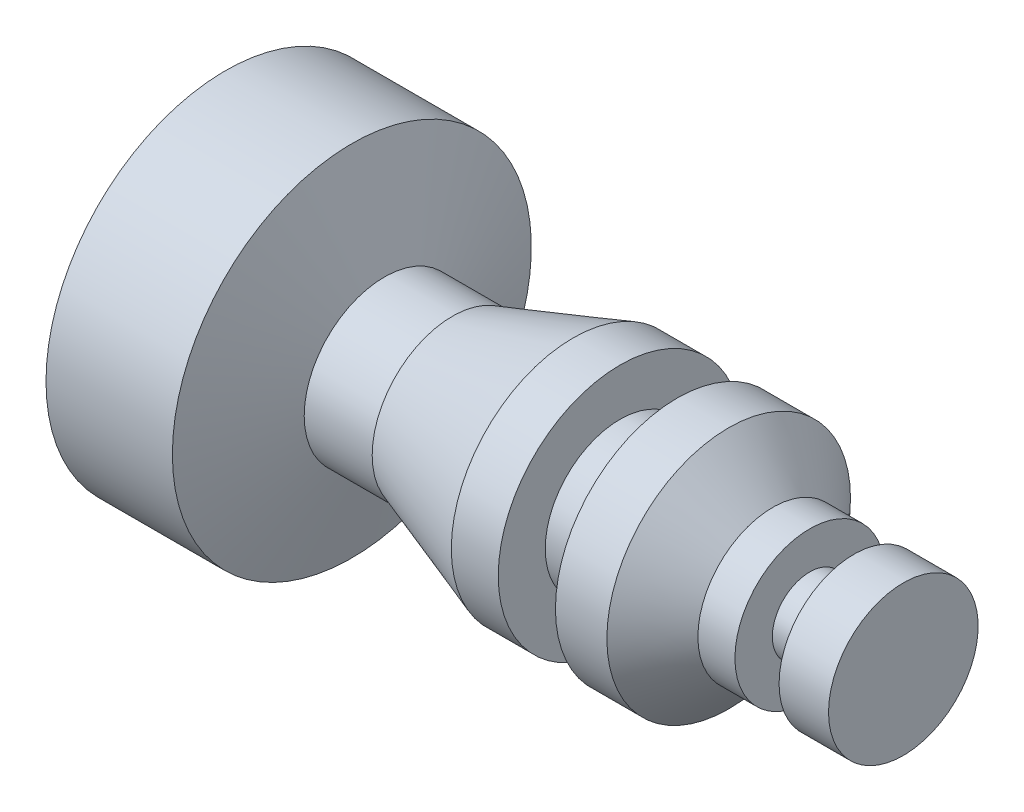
ISO-10303-21;
HEADER;
FILE_DESCRIPTION(('STEP AP214'),'2;1');
FILE_NAME('part.step','',(''),(''),'','','');
FILE_SCHEMA(('AUTOMOTIVE_DESIGN { 1 0 10303 214 1 1 1 1 }'));
ENDSEC;
DATA;
#1=APPLICATION_CONTEXT('core data for automotive mechanical design processes');
#2=APPLICATION_PROTOCOL_DEFINITION('international standard','automotive_design',2000,#1);
#3=PRODUCT_CONTEXT('',#1,'mechanical');
#4=PRODUCT('Part','Part','',(#3));
#5=PRODUCT_RELATED_PRODUCT_CATEGORY('part','',(#4));
#6=PRODUCT_DEFINITION_FORMATION('','',#4);
#7=PRODUCT_DEFINITION_CONTEXT('part definition',#1,'design');
#8=PRODUCT_DEFINITION('design','',#6,#7);
#9=PRODUCT_DEFINITION_SHAPE('','',#8);
#10=(LENGTH_UNIT() NAMED_UNIT(*) SI_UNIT(.MILLI.,.METRE.));
#11=(NAMED_UNIT(*) PLANE_ANGLE_UNIT() SI_UNIT($,.RADIAN.));
#12=(NAMED_UNIT(*) SI_UNIT($,.STERADIAN.) SOLID_ANGLE_UNIT());
#13=UNCERTAINTY_MEASURE_WITH_UNIT(LENGTH_MEASURE(1.E-05),#10,'distance_accuracy_value','');
#14=(GEOMETRIC_REPRESENTATION_CONTEXT(3) GLOBAL_UNCERTAINTY_ASSIGNED_CONTEXT((#13)) GLOBAL_UNIT_ASSIGNED_CONTEXT((#10,
#11,#12)) REPRESENTATION_CONTEXT('',''));
#15=CARTESIAN_POINT('',(0.,0.,0.));
#16=DIRECTION('',(0.,0.,1.));
#17=DIRECTION('',(1.,0.,0.));
#18=AXIS2_PLACEMENT_3D('',#15,#16,#17);
#19=CARTESIAN_POINT('',(178.686122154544,0.,0.));
#20=DIRECTION('',(1.,0.,0.));
#21=DIRECTION('',(0.,0.,-1.));
#22=AXIS2_PLACEMENT_3D('',#19,#20,#21);
#23=PLANE('',#22);
#24=CARTESIAN_POINT('',(178.686122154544,0.,0.));
#25=DIRECTION('',(-1.,0.,0.));
#26=DIRECTION('',(0.,0.,1.));
#27=AXIS2_PLACEMENT_3D('',#24,#25,#26);
#28=CIRCLE('',#27,34.5399453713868);
#29=CARTESIAN_POINT('',(178.686122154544,0.,34.5399453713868));
#30=VERTEX_POINT('',#29);
#31=EDGE_CURVE('E10',#30,#30,#28,.T.);
#32=ORIENTED_EDGE('',*,*,#31,.T.);
#33=EDGE_LOOP('',(#32));
#34=FACE_BOUND('',#33,.T.);
#35=ADVANCED_FACE('F35',(#34),#23,.F.);
#36=CARTESIAN_POINT('',(178.686122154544,0.,0.));
#37=DIRECTION('',(-1.,0.,0.));
#38=DIRECTION('',(0.,0.,1.));
#39=AXIS2_PLACEMENT_3D('',#36,#37,#38);
#40=CYLINDRICAL_SURFACE('',#39,34.5399453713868);
#41=ORIENTED_EDGE('',*,*,#31,.F.);
#42=EDGE_LOOP('',(#41));
#43=FACE_BOUND('',#42,.T.);
#44=CARTESIAN_POINT('',(203.007831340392,0.,0.));
#45=DIRECTION('',(-1.,0.,0.));
#46=DIRECTION('',(0.,0.,1.));
#47=AXIS2_PLACEMENT_3D('',#44,#45,#46);
#48=CIRCLE('',#47,34.5399453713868);
#49=CARTESIAN_POINT('',(203.007831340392,0.,34.5399453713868));
#50=VERTEX_POINT('',#49);
#51=EDGE_CURVE('E41',#50,#50,#48,.T.);
#52=ORIENTED_EDGE('',*,*,#51,.T.);
#53=EDGE_LOOP('',(#52));
#54=FACE_BOUND('',#53,.T.);
#55=ADVANCED_FACE('F103',(#43,#54),#40,.T.);
#56=CARTESIAN_POINT('',(209.278776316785,0.,0.));
#57=DIRECTION('',(-1.,0.,0.));
#58=DIRECTION('',(0.,0.,1.));
#59=AXIS2_PLACEMENT_3D('',#56,#57,#58);
#60=CONICAL_SURFACE('',#59,15.4420674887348,1.25353004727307);
#61=ORIENTED_EDGE('',*,*,#51,.F.);
#62=EDGE_LOOP('',(#61));
#63=FACE_BOUND('',#62,.T.);
#64=CARTESIAN_POINT('',(209.278776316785,0.,0.));
#65=DIRECTION('',(-1.,0.,0.));
#66=DIRECTION('',(0.,0.,1.));
#67=AXIS2_PLACEMENT_3D('',#64,#65,#66);
#68=CIRCLE('',#67,15.4420674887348);
#69=CARTESIAN_POINT('',(209.278776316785,0.,15.4420674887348));
#70=VERTEX_POINT('',#69);
#71=EDGE_CURVE('E45',#70,#70,#68,.T.);
#72=ORIENTED_EDGE('',*,*,#71,.T.);
#73=EDGE_LOOP('',(#72));
#74=FACE_BOUND('',#73,.T.);
#75=ADVANCED_FACE('F107',(#63,#74),#60,.T.);
#76=CARTESIAN_POINT('',(178.686122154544,0.,0.));
#77=DIRECTION('',(-1.,0.,0.));
#78=DIRECTION('',(0.,0.,1.));
#79=AXIS2_PLACEMENT_3D('',#76,#77,#78);
#80=CYLINDRICAL_SURFACE('',#79,15.4420674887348);
#81=ORIENTED_EDGE('',*,*,#71,.F.);
#82=EDGE_LOOP('',(#81));
#83=FACE_BOUND('',#82,.T.);
#84=CARTESIAN_POINT('',(222.363788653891,0.,0.));
#85=DIRECTION('',(-1.,0.,0.));
#86=DIRECTION('',(0.,0.,1.));
#87=AXIS2_PLACEMENT_3D('',#84,#85,#86);
#88=CIRCLE('',#87,15.4420674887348);
#89=CARTESIAN_POINT('',(222.363788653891,0.,15.4420674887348));
#90=VERTEX_POINT('',#89);
#91=EDGE_CURVE('E49',#90,#90,#88,.T.);
#92=ORIENTED_EDGE('',*,*,#91,.T.);
#93=EDGE_LOOP('',(#92));
#94=FACE_BOUND('',#93,.T.);
#95=ADVANCED_FACE('F112',(#83,#94),#80,.T.);
#96=CARTESIAN_POINT('',(245.590937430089,0.,0.));
#97=DIRECTION('',(1.,0.,0.));
#98=DIRECTION('',(0.,0.,-1.));
#99=AXIS2_PLACEMENT_3D('',#96,#97,#98);
#100=CONICAL_SURFACE('',#99,23.4425298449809,0.331717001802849);
#101=ORIENTED_EDGE('',*,*,#91,.F.);
#102=EDGE_LOOP('',(#101));
#103=FACE_BOUND('',#102,.T.);
#104=CARTESIAN_POINT('',(245.590937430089,0.,0.));
#105=DIRECTION('',(-1.,0.,0.));
#106=DIRECTION('',(0.,0.,1.));
#107=AXIS2_PLACEMENT_3D('',#104,#105,#106);
#108=CIRCLE('',#107,23.4425298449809);
#109=CARTESIAN_POINT('',(245.590937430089,0.,23.4425298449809));
#110=VERTEX_POINT('',#109);
#111=EDGE_CURVE('E54',#110,#110,#108,.T.);
#112=ORIENTED_EDGE('',*,*,#111,.T.);
#113=EDGE_LOOP('',(#112));
#114=FACE_BOUND('',#113,.T.);
#115=ADVANCED_FACE('F118',(#103,#114),#100,.T.);
#116=CARTESIAN_POINT('',(178.686122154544,0.,0.));
#117=DIRECTION('',(-1.,0.,0.));
#118=DIRECTION('',(0.,0.,1.));
#119=AXIS2_PLACEMENT_3D('',#116,#117,#118);
#120=CYLINDRICAL_SURFACE('',#119,23.4425298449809);
#121=ORIENTED_EDGE('',*,*,#111,.F.);
#122=EDGE_LOOP('',(#121));
#123=FACE_BOUND('',#122,.T.);
#124=CARTESIAN_POINT('',(254.623717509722,0.,0.));
#125=DIRECTION('',(-1.,0.,0.));
#126=DIRECTION('',(0.,0.,1.));
#127=AXIS2_PLACEMENT_3D('',#124,#125,#126);
#128=CIRCLE('',#127,23.4425298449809);
#129=CARTESIAN_POINT('',(254.623717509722,0.,23.4425298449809));
#130=VERTEX_POINT('',#129);
#131=EDGE_CURVE('E57',#130,#130,#128,.T.);
#132=ORIENTED_EDGE('',*,*,#131,.T.);
#133=EDGE_LOOP('',(#132));
#134=FACE_BOUND('',#133,.T.);
#135=ADVANCED_FACE('F122',(#123,#134),#120,.T.);
#136=CARTESIAN_POINT('',(254.623717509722,23.4425298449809,0.));
#137=DIRECTION('',(-1.,0.,0.));
#138=DIRECTION('',(0.,0.,1.));
#139=AXIS2_PLACEMENT_3D('',#136,#137,#138);
#140=PLANE('',#139);
#141=ORIENTED_EDGE('',*,*,#131,.F.);
#142=EDGE_LOOP('',(#141));
#143=FACE_BOUND('',#142,.T.);
#144=CARTESIAN_POINT('',(254.623717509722,0.,0.));
#145=DIRECTION('',(-1.,0.,0.));
#146=DIRECTION('',(0.,0.,1.));
#147=AXIS2_PLACEMENT_3D('',#144,#145,#146);
#148=CIRCLE('',#147,14.3965142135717);
#149=CARTESIAN_POINT('',(254.623717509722,0.,14.3965142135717));
#150=VERTEX_POINT('',#149);
#151=EDGE_CURVE('E60',#150,#150,#148,.T.);
#152=ORIENTED_EDGE('',*,*,#151,.T.);
#153=EDGE_LOOP('',(#152));
#154=FACE_BOUND('',#153,.T.);
#155=ADVANCED_FACE('F126',(#143,#154),#140,.F.);
#156=CARTESIAN_POINT('',(178.686122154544,0.,0.));
#157=DIRECTION('',(-1.,0.,0.));
#158=DIRECTION('',(0.,0.,1.));
#159=AXIS2_PLACEMENT_3D('',#156,#157,#158);
#160=CYLINDRICAL_SURFACE('',#159,14.3965142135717);
#161=ORIENTED_EDGE('',*,*,#151,.F.);
#162=EDGE_LOOP('',(#161));
#163=FACE_BOUND('',#162,.T.);
#164=CARTESIAN_POINT('',(265.628914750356,0.,0.));
#165=DIRECTION('',(-1.,0.,0.));
#166=DIRECTION('',(0.,0.,1.));
#167=AXIS2_PLACEMENT_3D('',#164,#165,#166);
#168=CIRCLE('',#167,14.3965142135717);
#169=CARTESIAN_POINT('',(265.628914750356,0.,14.3965142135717));
#170=VERTEX_POINT('',#169);
#171=EDGE_CURVE('E63',#170,#170,#168,.T.);
#172=ORIENTED_EDGE('',*,*,#171,.T.);
#173=EDGE_LOOP('',(#172));
#174=FACE_BOUND('',#173,.T.);
#175=ADVANCED_FACE('F130',(#163,#174),#160,.T.);
#176=CARTESIAN_POINT('',(265.628914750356,14.3965142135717,0.));
#177=DIRECTION('',(1.,0.,0.));
#178=DIRECTION('',(0.,0.,-1.));
#179=AXIS2_PLACEMENT_3D('',#176,#177,#178);
#180=PLANE('',#179);
#181=ORIENTED_EDGE('',*,*,#171,.F.);
#182=EDGE_LOOP('',(#181));
#183=FACE_BOUND('',#182,.T.);
#184=CARTESIAN_POINT('',(265.628914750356,0.,0.));
#185=DIRECTION('',(-1.,0.,0.));
#186=DIRECTION('',(0.,0.,1.));
#187=AXIS2_PLACEMENT_3D('',#184,#185,#186);
#188=CIRCLE('',#187,23.4425298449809);
#189=CARTESIAN_POINT('',(265.628914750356,0.,23.4425298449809));
#190=VERTEX_POINT('',#189);
#191=EDGE_CURVE('E66',#190,#190,#188,.T.);
#192=ORIENTED_EDGE('',*,*,#191,.T.);
#193=EDGE_LOOP('',(#192));
#194=FACE_BOUND('',#193,.T.);
#195=ADVANCED_FACE('F134',(#183,#194),#180,.F.);
#196=CARTESIAN_POINT('',(178.686122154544,0.,0.));
#197=DIRECTION('',(-1.,0.,0.));
#198=DIRECTION('',(0.,0.,1.));
#199=AXIS2_PLACEMENT_3D('',#196,#197,#198);
#200=CYLINDRICAL_SURFACE('',#199,23.4425298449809);
#201=ORIENTED_EDGE('',*,*,#191,.F.);
#202=EDGE_LOOP('',(#201));
#203=FACE_BOUND('',#202,.T.);
#204=CARTESIAN_POINT('',(275.528151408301,0.,0.));
#205=DIRECTION('',(-1.,0.,0.));
#206=DIRECTION('',(0.,0.,1.));
#207=AXIS2_PLACEMENT_3D('',#204,#205,#206);
#208=CIRCLE('',#207,23.4425298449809);
#209=CARTESIAN_POINT('',(275.528151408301,0.,23.4425298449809));
#210=VERTEX_POINT('',#209);
#211=EDGE_CURVE('E69',#210,#210,#208,.T.);
#212=ORIENTED_EDGE('',*,*,#211,.T.);
#213=EDGE_LOOP('',(#212));
#214=FACE_BOUND('',#213,.T.);
#215=ADVANCED_FACE('F138',(#203,#214),#200,.T.);
#216=CARTESIAN_POINT('',(283.997473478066,0.,0.));
#217=DIRECTION('',(-1.,0.,0.));
#218=DIRECTION('',(0.,0.,1.));
#219=AXIS2_PLACEMENT_3D('',#216,#217,#218);
#220=CONICAL_SURFACE('',#219,14.3965142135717,0.818311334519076);
#221=ORIENTED_EDGE('',*,*,#211,.F.);
#222=EDGE_LOOP('',(#221));
#223=FACE_BOUND('',#222,.T.);
#224=CARTESIAN_POINT('',(283.997473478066,0.,0.));
#225=DIRECTION('',(-1.,0.,0.));
#226=DIRECTION('',(0.,0.,1.));
#227=AXIS2_PLACEMENT_3D('',#224,#225,#226);
#228=CIRCLE('',#227,14.3965142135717);
#229=CARTESIAN_POINT('',(283.997473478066,0.,14.3965142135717));
#230=VERTEX_POINT('',#229);
#231=EDGE_CURVE('E72',#230,#230,#228,.T.);
#232=ORIENTED_EDGE('',*,*,#231,.T.);
#233=EDGE_LOOP('',(#232));
#234=FACE_BOUND('',#233,.T.);
#235=ADVANCED_FACE('F142',(#223,#234),#220,.T.);
#236=CARTESIAN_POINT('',(178.686122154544,0.,0.));
#237=DIRECTION('',(-1.,0.,0.));
#238=DIRECTION('',(0.,0.,1.));
#239=AXIS2_PLACEMENT_3D('',#236,#237,#238);
#240=CYLINDRICAL_SURFACE('',#239,14.3965142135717);
#241=ORIENTED_EDGE('',*,*,#231,.F.);
#242=EDGE_LOOP('',(#241));
#243=FACE_BOUND('',#242,.T.);
#244=CARTESIAN_POINT('',(291.124113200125,0.,0.));
#245=DIRECTION('',(-1.,0.,0.));
#246=DIRECTION('',(0.,0.,1.));
#247=AXIS2_PLACEMENT_3D('',#244,#245,#246);
#248=CIRCLE('',#247,14.3965142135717);
#249=CARTESIAN_POINT('',(291.124113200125,0.,14.3965142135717));
#250=VERTEX_POINT('',#249);
#251=EDGE_CURVE('E75',#250,#250,#248,.T.);
#252=ORIENTED_EDGE('',*,*,#251,.T.);
#253=EDGE_LOOP('',(#252));
#254=FACE_BOUND('',#253,.T.);
#255=ADVANCED_FACE('F146',(#243,#254),#240,.T.);
#256=CARTESIAN_POINT('',(291.124113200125,14.3965142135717,0.));
#257=DIRECTION('',(-1.,0.,0.));
#258=DIRECTION('',(0.,0.,1.));
#259=AXIS2_PLACEMENT_3D('',#256,#257,#258);
#260=PLANE('',#259);
#261=ORIENTED_EDGE('',*,*,#251,.F.);
#262=EDGE_LOOP('',(#261));
#263=FACE_BOUND('',#262,.T.);
#264=CARTESIAN_POINT('',(291.124113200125,0.,0.));
#265=DIRECTION('',(-1.,0.,0.));
#266=DIRECTION('',(0.,0.,1.));
#267=AXIS2_PLACEMENT_3D('',#264,#265,#266);
#268=CIRCLE('',#267,7.19825710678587);
#269=CARTESIAN_POINT('',(291.124113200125,0.,7.19825710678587));
#270=VERTEX_POINT('',#269);
#271=EDGE_CURVE('E78',#270,#270,#268,.T.);
#272=ORIENTED_EDGE('',*,*,#271,.T.);
#273=EDGE_LOOP('',(#272));
#274=FACE_BOUND('',#273,.T.);
#275=ADVANCED_FACE('F150',(#263,#274),#260,.F.);
#276=CARTESIAN_POINT('',(178.686122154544,0.,0.));
#277=DIRECTION('',(-1.,0.,0.));
#278=DIRECTION('',(0.,0.,1.));
#279=AXIS2_PLACEMENT_3D('',#276,#277,#278);
#280=CYLINDRICAL_SURFACE('',#279,7.19825710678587);
#281=ORIENTED_EDGE('',*,*,#271,.F.);
#282=EDGE_LOOP('',(#281));
#283=FACE_BOUND('',#282,.T.);
#284=CARTESIAN_POINT('',(299.622512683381,0.,0.));
#285=DIRECTION('',(-1.,0.,0.));
#286=DIRECTION('',(0.,0.,1.));
#287=AXIS2_PLACEMENT_3D('',#284,#285,#286);
#288=CIRCLE('',#287,7.19825710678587);
#289=CARTESIAN_POINT('',(299.622512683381,0.,7.19825710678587));
#290=VERTEX_POINT('',#289);
#291=EDGE_CURVE('E81',#290,#290,#288,.T.);
#292=ORIENTED_EDGE('',*,*,#291,.T.);
#293=EDGE_LOOP('',(#292));
#294=FACE_BOUND('',#293,.T.);
#295=ADVANCED_FACE('F154',(#283,#294),#280,.T.);
#296=CARTESIAN_POINT('',(299.622512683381,7.19825710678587,0.));
#297=DIRECTION('',(1.,0.,0.));
#298=DIRECTION('',(0.,0.,-1.));
#299=AXIS2_PLACEMENT_3D('',#296,#297,#298);
#300=PLANE('',#299);
#301=ORIENTED_EDGE('',*,*,#291,.F.);
#302=EDGE_LOOP('',(#301));
#303=FACE_BOUND('',#302,.T.);
#304=CARTESIAN_POINT('',(299.622512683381,0.,0.));
#305=DIRECTION('',(-1.,0.,0.));
#306=DIRECTION('',(0.,0.,1.));
#307=AXIS2_PLACEMENT_3D('',#304,#305,#306);
#308=CIRCLE('',#307,14.3965142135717);
#309=CARTESIAN_POINT('',(299.622512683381,0.,14.3965142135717));
#310=VERTEX_POINT('',#309);
#311=EDGE_CURVE('E84',#310,#310,#308,.T.);
#312=ORIENTED_EDGE('',*,*,#311,.T.);
#313=EDGE_LOOP('',(#312));
#314=FACE_BOUND('',#313,.T.);
#315=ADVANCED_FACE('F99',(#303,#314),#300,.F.);
#316=CARTESIAN_POINT('',(178.686122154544,0.,0.));
#317=DIRECTION('',(-1.,0.,0.));
#318=DIRECTION('',(0.,0.,1.));
#319=AXIS2_PLACEMENT_3D('',#316,#317,#318);
#320=CYLINDRICAL_SURFACE('',#319,14.3965142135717);
#321=ORIENTED_EDGE('',*,*,#311,.F.);
#322=EDGE_LOOP('',(#321));
#323=FACE_BOUND('',#322,.T.);
#324=CARTESIAN_POINT('',(309.140720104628,0.,0.));
#325=DIRECTION('',(-1.,0.,0.));
#326=DIRECTION('',(0.,0.,1.));
#327=AXIS2_PLACEMENT_3D('',#324,#325,#326);
#328=CIRCLE('',#327,14.3965142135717);
#329=CARTESIAN_POINT('',(309.140720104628,0.,14.3965142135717));
#330=VERTEX_POINT('',#329);
#331=EDGE_CURVE('E87',#330,#330,#328,.T.);
#332=ORIENTED_EDGE('',*,*,#331,.T.);
#333=EDGE_LOOP('',(#332));
#334=FACE_BOUND('',#333,.T.);
#335=ADVANCED_FACE('F91',(#323,#334),#320,.T.);
#336=CARTESIAN_POINT('',(309.140720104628,14.3965142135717,0.));
#337=DIRECTION('',(-1.,0.,0.));
#338=DIRECTION('',(0.,0.,1.));
#339=AXIS2_PLACEMENT_3D('',#336,#337,#338);
#340=PLANE('',#339);
#341=ORIENTED_EDGE('',*,*,#331,.F.);
#342=EDGE_LOOP('',(#341));
#343=FACE_BOUND('',#342,.T.);
#344=ADVANCED_FACE('F93',(#343),#340,.F.);
#345=CLOSED_SHELL('',(#35,#55,#75,#95,#115,#135,#155,#175,#195,#215,#235,#255,#275,#295,#315,
#335,#344));
#346=MANIFOLD_SOLID_BREP('B2',#345);
#347=ADVANCED_BREP_SHAPE_REPRESENTATION('',(#18,#346),#14);
#348=SHAPE_DEFINITION_REPRESENTATION(#9,#347);
ENDSEC;
END-ISO-10303-21;
